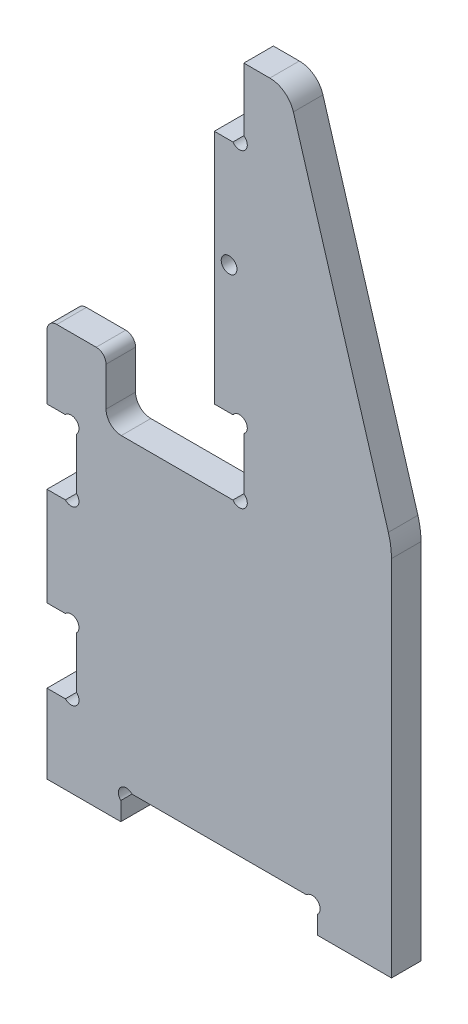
ISO-10303-21;
HEADER;
FILE_DESCRIPTION(('STEP AP214'),'2;1');
FILE_NAME('part.step','',(''),(''),'','','');
FILE_SCHEMA(('AUTOMOTIVE_DESIGN { 1 0 10303 214 1 1 1 1 }'));
ENDSEC;
DATA;
#1=APPLICATION_CONTEXT('core data for automotive mechanical design processes');
#2=APPLICATION_PROTOCOL_DEFINITION('international standard','automotive_design',2000,#1);
#3=PRODUCT_CONTEXT('',#1,'mechanical');
#4=PRODUCT('Part','Part','',(#3));
#5=PRODUCT_RELATED_PRODUCT_CATEGORY('part','',(#4));
#6=PRODUCT_DEFINITION_FORMATION('','',#4);
#7=PRODUCT_DEFINITION_CONTEXT('part definition',#1,'design');
#8=PRODUCT_DEFINITION('design','',#6,#7);
#9=PRODUCT_DEFINITION_SHAPE('','',#8);
#10=(LENGTH_UNIT() NAMED_UNIT(*) SI_UNIT(.MILLI.,.METRE.));
#11=(NAMED_UNIT(*) PLANE_ANGLE_UNIT() SI_UNIT($,.RADIAN.));
#12=(NAMED_UNIT(*) SI_UNIT($,.STERADIAN.) SOLID_ANGLE_UNIT());
#13=UNCERTAINTY_MEASURE_WITH_UNIT(LENGTH_MEASURE(1.E-05),#10,'distance_accuracy_value','');
#14=(GEOMETRIC_REPRESENTATION_CONTEXT(3) GLOBAL_UNCERTAINTY_ASSIGNED_CONTEXT((#13)) GLOBAL_UNIT_ASSIGNED_CONTEXT((#10,
#11,#12)) REPRESENTATION_CONTEXT('',''));
#15=CARTESIAN_POINT('',(0.,0.,0.));
#16=DIRECTION('',(0.,0.,1.));
#17=DIRECTION('',(1.,0.,0.));
#18=AXIS2_PLACEMENT_3D('',#15,#16,#17);
#19=CARTESIAN_POINT('',(-13.,3.,-6.));
#20=DIRECTION('',(0.,0.,1.));
#21=DIRECTION('',(1.,0.,0.));
#22=AXIS2_PLACEMENT_3D('',#19,#20,#21);
#23=CYLINDRICAL_SURFACE('',#22,2.);
#24=CARTESIAN_POINT('',(-13.,3.,0.));
#25=DIRECTION('',(0.,0.,1.));
#26=DIRECTION('',(-1.,0.,0.));
#27=AXIS2_PLACEMENT_3D('',#24,#25,#26);
#28=CIRCLE('',#27,2.);
#29=CARTESIAN_POINT('',(-13.,5.,0.));
#30=VERTEX_POINT('',#29);
#31=CARTESIAN_POINT('',(-15.,2.99999999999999,0.));
#32=VERTEX_POINT('',#31);
#33=EDGE_CURVE('E285',#30,#32,#28,.T.);
#34=ORIENTED_EDGE('',*,*,#33,.F.);
#35=DIRECTION('',(0.,0.,1.));
#36=VECTOR('',#35,1.);
#37=CARTESIAN_POINT('',(-13.,5.,-6.));
#38=LINE('',#37,#36);
#39=CARTESIAN_POINT('',(-13.,5.,-6.));
#40=VERTEX_POINT('',#39);
#41=EDGE_CURVE('E11',#40,#30,#38,.T.);
#42=ORIENTED_EDGE('',*,*,#41,.F.);
#43=CARTESIAN_POINT('',(-13.,3.,-6.));
#44=DIRECTION('',(0.,0.,1.));
#45=DIRECTION('',(-1.,0.,0.));
#46=AXIS2_PLACEMENT_3D('',#43,#44,#45);
#47=CIRCLE('',#46,2.);
#48=CARTESIAN_POINT('',(-15.,2.99999999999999,-6.));
#49=VERTEX_POINT('',#48);
#50=EDGE_CURVE('E287',#40,#49,#47,.T.);
#51=ORIENTED_EDGE('',*,*,#50,.T.);
#52=DIRECTION('',(0.,0.,1.));
#53=VECTOR('',#52,1.);
#54=CARTESIAN_POINT('',(-15.,2.99999999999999,-6.));
#55=LINE('',#54,#53);
#56=EDGE_CURVE('E38',#49,#32,#55,.T.);
#57=ORIENTED_EDGE('',*,*,#56,.T.);
#58=EDGE_LOOP('',(#34,#42,#51,#57));
#59=FACE_BOUND('',#58,.T.);
#60=ADVANCED_FACE('F35',(#59),#23,.T.);
#61=CARTESIAN_POINT('',(-13.,5.,-6.));
#62=DIRECTION('',(0.,1.,0.));
#63=DIRECTION('',(-1.,0.,0.));
#64=AXIS2_PLACEMENT_3D('',#61,#62,#63);
#65=PLANE('',#64);
#66=DIRECTION('',(-1.,0.,0.));
#67=VECTOR('',#66,1.);
#68=CARTESIAN_POINT('',(-13.,5.,0.));
#69=LINE('',#68,#67);
#70=CARTESIAN_POINT('',(-5.00000000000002,5.,0.));
#71=VERTEX_POINT('',#70);
#72=EDGE_CURVE('E303',#71,#30,#69,.T.);
#73=ORIENTED_EDGE('',*,*,#72,.F.);
#74=DIRECTION('',(0.,0.,1.));
#75=VECTOR('',#74,1.);
#76=CARTESIAN_POINT('',(-5.00000000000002,5.,-6.));
#77=LINE('',#76,#75);
#78=CARTESIAN_POINT('',(-5.00000000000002,5.,-6.));
#79=VERTEX_POINT('',#78);
#80=EDGE_CURVE('E43',#79,#71,#77,.T.);
#81=ORIENTED_EDGE('',*,*,#80,.F.);
#82=DIRECTION('',(-1.,0.,0.));
#83=VECTOR('',#82,1.);
#84=CARTESIAN_POINT('',(-13.,5.,-6.));
#85=LINE('',#84,#83);
#86=EDGE_CURVE('E292',#79,#40,#85,.T.);
#87=ORIENTED_EDGE('',*,*,#86,.T.);
#88=ORIENTED_EDGE('',*,*,#41,.T.);
#89=EDGE_LOOP('',(#73,#81,#87,#88));
#90=FACE_BOUND('',#89,.T.);
#91=ADVANCED_FACE('F741',(#90),#65,.T.);
#92=CARTESIAN_POINT('',(-5.00000000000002,3.,-6.));
#93=DIRECTION('',(0.,0.,1.));
#94=DIRECTION('',(1.,0.,0.));
#95=AXIS2_PLACEMENT_3D('',#92,#93,#94);
#96=CYLINDRICAL_SURFACE('',#95,2.);
#97=CARTESIAN_POINT('',(-5.00000000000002,3.,0.));
#98=DIRECTION('',(0.,0.,1.));
#99=DIRECTION('',(-1.,0.,0.));
#100=AXIS2_PLACEMENT_3D('',#97,#98,#99);
#101=CIRCLE('',#100,2.);
#102=CARTESIAN_POINT('',(-3.00000000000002,3.,0.));
#103=VERTEX_POINT('',#102);
#104=EDGE_CURVE('E414',#103,#71,#101,.T.);
#105=ORIENTED_EDGE('',*,*,#104,.F.);
#106=DIRECTION('',(0.,0.,1.));
#107=VECTOR('',#106,1.);
#108=CARTESIAN_POINT('',(-3.00000000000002,3.,-6.));
#109=LINE('',#108,#107);
#110=CARTESIAN_POINT('',(-3.00000000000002,3.,-6.));
#111=VERTEX_POINT('',#110);
#112=EDGE_CURVE('E527',#111,#103,#109,.T.);
#113=ORIENTED_EDGE('',*,*,#112,.F.);
#114=CARTESIAN_POINT('',(-5.00000000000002,3.,-6.));
#115=DIRECTION('',(0.,0.,1.));
#116=DIRECTION('',(-1.,0.,0.));
#117=AXIS2_PLACEMENT_3D('',#114,#115,#116);
#118=CIRCLE('',#117,2.);
#119=EDGE_CURVE('E523',#111,#79,#118,.T.);
#120=ORIENTED_EDGE('',*,*,#119,.T.);
#121=ORIENTED_EDGE('',*,*,#80,.T.);
#122=EDGE_LOOP('',(#105,#113,#120,#121));
#123=FACE_BOUND('',#122,.T.);
#124=ADVANCED_FACE('F744',(#123),#96,.T.);
#125=CARTESIAN_POINT('',(-3.00000000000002,-4.89999999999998,-6.));
#126=DIRECTION('',(1.,0.,0.));
#127=DIRECTION('',(0.,0.,-1.));
#128=AXIS2_PLACEMENT_3D('',#125,#126,#127);
#129=PLANE('',#128);
#130=DIRECTION('',(0.,1.,0.));
#131=VECTOR('',#130,1.);
#132=CARTESIAN_POINT('',(-3.00000000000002,-4.89999999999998,0.));
#133=LINE('',#132,#131);
#134=CARTESIAN_POINT('',(-3.00000000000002,-4.89999999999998,0.));
#135=VERTEX_POINT('',#134);
#136=EDGE_CURVE('E411',#135,#103,#133,.T.);
#137=ORIENTED_EDGE('',*,*,#136,.F.);
#138=DIRECTION('',(0.,0.,1.));
#139=VECTOR('',#138,1.);
#140=CARTESIAN_POINT('',(-3.00000000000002,-4.89999999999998,-6.));
#141=LINE('',#140,#139);
#142=CARTESIAN_POINT('',(-3.00000000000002,-4.89999999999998,-6.));
#143=VERTEX_POINT('',#142);
#144=EDGE_CURVE('E529',#143,#135,#141,.T.);
#145=ORIENTED_EDGE('',*,*,#144,.F.);
#146=DIRECTION('',(0.,1.,0.));
#147=VECTOR('',#146,1.);
#148=CARTESIAN_POINT('',(-3.00000000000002,-4.89999999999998,-6.));
#149=LINE('',#148,#147);
#150=EDGE_CURVE('E520',#143,#111,#149,.T.);
#151=ORIENTED_EDGE('',*,*,#150,.T.);
#152=ORIENTED_EDGE('',*,*,#112,.T.);
#153=EDGE_LOOP('',(#137,#145,#151,#152));
#154=FACE_BOUND('',#153,.T.);
#155=ADVANCED_FACE('F738',(#154),#129,.T.);
#156=CARTESIAN_POINT('',(0.0999999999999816,-4.9,-6.));
#157=DIRECTION('',(0.,0.,1.));
#158=DIRECTION('',(1.,0.,0.));
#159=AXIS2_PLACEMENT_3D('',#156,#157,#158);
#160=CYLINDRICAL_SURFACE('',#159,3.1);
#161=CARTESIAN_POINT('',(0.0999999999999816,-4.9,0.));
#162=DIRECTION('',(0.,0.,-1.));
#163=DIRECTION('',(-1.,0.,0.));
#164=AXIS2_PLACEMENT_3D('',#161,#162,#163);
#165=CIRCLE('',#164,3.1);
#166=CARTESIAN_POINT('',(0.100000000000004,-8.,0.));
#167=VERTEX_POINT('',#166);
#168=EDGE_CURVE('E408',#167,#135,#165,.T.);
#169=ORIENTED_EDGE('',*,*,#168,.F.);
#170=DIRECTION('',(0.,0.,1.));
#171=VECTOR('',#170,1.);
#172=CARTESIAN_POINT('',(0.100000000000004,-8.,-6.));
#173=LINE('',#172,#171);
#174=CARTESIAN_POINT('',(0.100000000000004,-8.,-6.));
#175=VERTEX_POINT('',#174);
#176=EDGE_CURVE('E531',#175,#167,#173,.T.);
#177=ORIENTED_EDGE('',*,*,#176,.F.);
#178=CARTESIAN_POINT('',(0.0999999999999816,-4.9,-6.));
#179=DIRECTION('',(0.,0.,-1.));
#180=DIRECTION('',(-1.,0.,0.));
#181=AXIS2_PLACEMENT_3D('',#178,#179,#180);
#182=CIRCLE('',#181,3.1);
#183=EDGE_CURVE('E517',#175,#143,#182,.T.);
#184=ORIENTED_EDGE('',*,*,#183,.T.);
#185=ORIENTED_EDGE('',*,*,#144,.T.);
#186=EDGE_LOOP('',(#169,#177,#184,#185));
#187=FACE_BOUND('',#186,.T.);
#188=ADVANCED_FACE('F734',(#187),#160,.F.);
#189=CARTESIAN_POINT('',(0.100000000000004,-8.,-6.));
#190=DIRECTION('',(0.,1.,0.));
#191=DIRECTION('',(-1.,0.,0.));
#192=AXIS2_PLACEMENT_3D('',#189,#190,#191);
#193=PLANE('',#192);
#194=DIRECTION('',(-1.,0.,0.));
#195=VECTOR('',#194,1.);
#196=CARTESIAN_POINT('',(0.100000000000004,-8.,0.));
#197=LINE('',#196,#195);
#198=CARTESIAN_POINT('',(22.7771243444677,-8.,0.));
#199=VERTEX_POINT('',#198);
#200=EDGE_CURVE('E405',#199,#167,#197,.T.);
#201=ORIENTED_EDGE('',*,*,#200,.F.);
#202=DIRECTION('',(0.,0.,1.));
#203=VECTOR('',#202,1.);
#204=CARTESIAN_POINT('',(22.7771243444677,-8.,-6.));
#205=LINE('',#204,#203);
#206=CARTESIAN_POINT('',(22.7771243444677,-8.,-6.));
#207=VERTEX_POINT('',#206);
#208=EDGE_CURVE('E533',#207,#199,#205,.T.);
#209=ORIENTED_EDGE('',*,*,#208,.F.);
#210=DIRECTION('',(-1.,0.,0.));
#211=VECTOR('',#210,1.);
#212=CARTESIAN_POINT('',(22.7771243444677,-8.,-6.));
#213=LINE('',#212,#211);
#214=EDGE_CURVE('E515',#207,#175,#213,.T.);
#215=ORIENTED_EDGE('',*,*,#214,.T.);
#216=ORIENTED_EDGE('',*,*,#176,.T.);
#217=EDGE_LOOP('',(#201,#209,#215,#216));
#218=FACE_BOUND('',#217,.T.);
#219=ADVANCED_FACE('F729',(#218),#193,.T.);
#220=CARTESIAN_POINT('',(24.1,-7.1,-6.));
#221=DIRECTION('',(0.,0.,1.));
#222=DIRECTION('',(1.,0.,0.));
#223=AXIS2_PLACEMENT_3D('',#220,#221,#222);
#224=CYLINDRICAL_SURFACE('',#223,1.6);
#225=CARTESIAN_POINT('',(24.1,-7.1,0.));
#226=DIRECTION('',(0.,0.,-1.));
#227=DIRECTION('',(1.,0.,0.));
#228=AXIS2_PLACEMENT_3D('',#225,#226,#227);
#229=CIRCLE('',#228,1.6);
#230=CARTESIAN_POINT('',(25.,-5.77712434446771,0.));
#231=VERTEX_POINT('',#230);
#232=EDGE_CURVE('E402',#231,#199,#229,.T.);
#233=ORIENTED_EDGE('',*,*,#232,.F.);
#234=DIRECTION('',(0.,0.,1.));
#235=VECTOR('',#234,1.);
#236=CARTESIAN_POINT('',(25.,-5.77712434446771,-6.));
#237=LINE('',#236,#235);
#238=CARTESIAN_POINT('',(25.,-5.77712434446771,-6.));
#239=VERTEX_POINT('',#238);
#240=EDGE_CURVE('E536',#239,#231,#237,.T.);
#241=ORIENTED_EDGE('',*,*,#240,.F.);
#242=CARTESIAN_POINT('',(24.1,-7.1,-6.));
#243=DIRECTION('',(0.,0.,-1.));
#244=DIRECTION('',(1.,0.,0.));
#245=AXIS2_PLACEMENT_3D('',#242,#243,#244);
#246=CIRCLE('',#245,1.6);
#247=EDGE_CURVE('E512',#239,#207,#246,.T.);
#248=ORIENTED_EDGE('',*,*,#247,.T.);
#249=ORIENTED_EDGE('',*,*,#208,.T.);
#250=EDGE_LOOP('',(#233,#241,#248,#249));
#251=FACE_BOUND('',#250,.T.);
#252=ADVANCED_FACE('F726',(#251),#224,.F.);
#253=CARTESIAN_POINT('',(25.,4.77712434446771,-6.));
#254=DIRECTION('',(-1.,0.,0.));
#255=DIRECTION('',(0.,0.,1.));
#256=AXIS2_PLACEMENT_3D('',#253,#254,#255);
#257=PLANE('',#256);
#258=DIRECTION('',(0.,-1.,0.));
#259=VECTOR('',#258,1.);
#260=CARTESIAN_POINT('',(25.,4.77712434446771,0.));
#261=LINE('',#260,#259);
#262=CARTESIAN_POINT('',(25.,4.77712434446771,0.));
#263=VERTEX_POINT('',#262);
#264=EDGE_CURVE('E399',#263,#231,#261,.T.);
#265=ORIENTED_EDGE('',*,*,#264,.F.);
#266=DIRECTION('',(0.,0.,1.));
#267=VECTOR('',#266,1.);
#268=CARTESIAN_POINT('',(25.,4.77712434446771,-6.));
#269=LINE('',#268,#267);
#270=CARTESIAN_POINT('',(25.,4.77712434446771,-6.));
#271=VERTEX_POINT('',#270);
#272=EDGE_CURVE('E538',#271,#263,#269,.T.);
#273=ORIENTED_EDGE('',*,*,#272,.F.);
#274=DIRECTION('',(0.,-1.,0.));
#275=VECTOR('',#274,1.);
#276=CARTESIAN_POINT('',(25.,4.77712434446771,-6.));
#277=LINE('',#276,#275);
#278=EDGE_CURVE('E509',#271,#239,#277,.T.);
#279=ORIENTED_EDGE('',*,*,#278,.T.);
#280=ORIENTED_EDGE('',*,*,#240,.T.);
#281=EDGE_LOOP('',(#265,#273,#279,#280));
#282=FACE_BOUND('',#281,.T.);
#283=ADVANCED_FACE('F722',(#282),#257,.T.);
#284=CARTESIAN_POINT('',(24.1,6.1,-6.));
#285=DIRECTION('',(0.,0.,1.));
#286=DIRECTION('',(1.,0.,0.));
#287=AXIS2_PLACEMENT_3D('',#284,#285,#286);
#288=CYLINDRICAL_SURFACE('',#287,1.6);
#289=CARTESIAN_POINT('',(24.1,6.1,0.));
#290=DIRECTION('',(0.,0.,-1.));
#291=DIRECTION('',(1.,0.,0.));
#292=AXIS2_PLACEMENT_3D('',#289,#290,#291);
#293=CIRCLE('',#292,1.6);
#294=CARTESIAN_POINT('',(22.7771243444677,7.,0.));
#295=VERTEX_POINT('',#294);
#296=EDGE_CURVE('E396',#295,#263,#293,.T.);
#297=ORIENTED_EDGE('',*,*,#296,.F.);
#298=DIRECTION('',(0.,0.,1.));
#299=VECTOR('',#298,1.);
#300=CARTESIAN_POINT('',(22.7771243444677,7.,-6.));
#301=LINE('',#300,#299);
#302=CARTESIAN_POINT('',(22.7771243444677,7.,-6.));
#303=VERTEX_POINT('',#302);
#304=EDGE_CURVE('E540',#303,#295,#301,.T.);
#305=ORIENTED_EDGE('',*,*,#304,.F.);
#306=CARTESIAN_POINT('',(24.1,6.1,-6.));
#307=DIRECTION('',(0.,0.,-1.));
#308=DIRECTION('',(1.,0.,0.));
#309=AXIS2_PLACEMENT_3D('',#306,#307,#308);
#310=CIRCLE('',#309,1.6);
#311=EDGE_CURVE('E506',#303,#271,#310,.T.);
#312=ORIENTED_EDGE('',*,*,#311,.T.);
#313=ORIENTED_EDGE('',*,*,#272,.T.);
#314=EDGE_LOOP('',(#297,#305,#312,#313));
#315=FACE_BOUND('',#314,.T.);
#316=ADVANCED_FACE('F718',(#315),#288,.F.);
#317=CARTESIAN_POINT('',(19.,7.,-6.));
#318=DIRECTION('',(0.,-1.,0.));
#319=DIRECTION('',(1.,0.,0.));
#320=AXIS2_PLACEMENT_3D('',#317,#318,#319);
#321=PLANE('',#320);
#322=DIRECTION('',(1.,0.,0.));
#323=VECTOR('',#322,1.);
#324=CARTESIAN_POINT('',(19.,7.,0.));
#325=LINE('',#324,#323);
#326=CARTESIAN_POINT('',(19.,7.,0.));
#327=VERTEX_POINT('',#326);
#328=EDGE_CURVE('E393',#327,#295,#325,.T.);
#329=ORIENTED_EDGE('',*,*,#328,.F.);
#330=DIRECTION('',(0.,0.,1.));
#331=VECTOR('',#330,1.);
#332=CARTESIAN_POINT('',(19.,7.,-6.));
#333=LINE('',#332,#331);
#334=CARTESIAN_POINT('',(19.,7.,-6.));
#335=VERTEX_POINT('',#334);
#336=EDGE_CURVE('E542',#335,#327,#333,.T.);
#337=ORIENTED_EDGE('',*,*,#336,.F.);
#338=DIRECTION('',(1.,0.,0.));
#339=VECTOR('',#338,1.);
#340=CARTESIAN_POINT('',(19.,7.,-6.));
#341=LINE('',#340,#339);
#342=EDGE_CURVE('E503',#335,#303,#341,.T.);
#343=ORIENTED_EDGE('',*,*,#342,.T.);
#344=ORIENTED_EDGE('',*,*,#304,.T.);
#345=EDGE_LOOP('',(#329,#337,#343,#344));
#346=FACE_BOUND('',#345,.T.);
#347=ADVANCED_FACE('F714',(#346),#321,.T.);
#348=CARTESIAN_POINT('',(19.,7.,-6.));
#349=DIRECTION('',(-1.,0.,0.));
#350=DIRECTION('',(0.,-1.,0.));
#351=AXIS2_PLACEMENT_3D('',#348,#349,#350);
#352=PLANE('',#351);
#353=DIRECTION('',(0.,-1.,0.));
#354=VECTOR('',#353,1.);
#355=CARTESIAN_POINT('',(19.,7.,0.));
#356=LINE('',#355,#354);
#357=CARTESIAN_POINT('',(19.,55.,0.));
#358=VERTEX_POINT('',#357);
#359=EDGE_CURVE('E390',#358,#327,#356,.T.);
#360=ORIENTED_EDGE('',*,*,#359,.F.);
#361=DIRECTION('',(0.,0.,1.));
#362=VECTOR('',#361,1.);
#363=CARTESIAN_POINT('',(19.,55.,-6.));
#364=LINE('',#363,#362);
#365=CARTESIAN_POINT('',(19.,55.,-6.));
#366=VERTEX_POINT('',#365);
#367=EDGE_CURVE('E544',#366,#358,#364,.T.);
#368=ORIENTED_EDGE('',*,*,#367,.F.);
#369=DIRECTION('',(0.,-1.,0.));
#370=VECTOR('',#369,1.);
#371=CARTESIAN_POINT('',(19.,7.,-6.));
#372=LINE('',#371,#370);
#373=EDGE_CURVE('E500',#366,#335,#372,.T.);
#374=ORIENTED_EDGE('',*,*,#373,.T.);
#375=ORIENTED_EDGE('',*,*,#336,.T.);
#376=EDGE_LOOP('',(#360,#368,#374,#375));
#377=FACE_BOUND('',#376,.T.);
#378=ADVANCED_FACE('F710',(#377),#352,.T.);
#379=CARTESIAN_POINT('',(22.7771243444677,55.,-6.));
#380=DIRECTION('',(0.,1.,0.));
#381=DIRECTION('',(0.,0.,1.));
#382=AXIS2_PLACEMENT_3D('',#379,#380,#381);
#383=PLANE('',#382);
#384=DIRECTION('',(-1.,0.,0.));
#385=VECTOR('',#384,1.);
#386=CARTESIAN_POINT('',(22.7771243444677,55.,0.));
#387=LINE('',#386,#385);
#388=CARTESIAN_POINT('',(22.7771243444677,55.,0.));
#389=VERTEX_POINT('',#388);
#390=EDGE_CURVE('E387',#389,#358,#387,.T.);
#391=ORIENTED_EDGE('',*,*,#390,.F.);
#392=DIRECTION('',(0.,0.,1.));
#393=VECTOR('',#392,1.);
#394=CARTESIAN_POINT('',(22.7771243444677,55.,-6.));
#395=LINE('',#394,#393);
#396=CARTESIAN_POINT('',(22.7771243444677,55.,-6.));
#397=VERTEX_POINT('',#396);
#398=EDGE_CURVE('E546',#397,#389,#395,.T.);
#399=ORIENTED_EDGE('',*,*,#398,.F.);
#400=DIRECTION('',(-1.,0.,0.));
#401=VECTOR('',#400,1.);
#402=CARTESIAN_POINT('',(22.7771243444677,55.,-6.));
#403=LINE('',#402,#401);
#404=EDGE_CURVE('E497',#397,#366,#403,.T.);
#405=ORIENTED_EDGE('',*,*,#404,.T.);
#406=ORIENTED_EDGE('',*,*,#367,.T.);
#407=EDGE_LOOP('',(#391,#399,#405,#406));
#408=FACE_BOUND('',#407,.T.);
#409=ADVANCED_FACE('F706',(#408),#383,.T.);
#410=CARTESIAN_POINT('',(24.1,55.9,-6.));
#411=DIRECTION('',(0.,0.,1.));
#412=DIRECTION('',(1.,0.,0.));
#413=AXIS2_PLACEMENT_3D('',#410,#411,#412);
#414=CYLINDRICAL_SURFACE('',#413,1.6);
#415=CARTESIAN_POINT('',(24.1,55.9,0.));
#416=DIRECTION('',(0.,0.,-1.));
#417=DIRECTION('',(1.,0.,0.));
#418=AXIS2_PLACEMENT_3D('',#415,#416,#417);
#419=CIRCLE('',#418,1.6);
#420=CARTESIAN_POINT('',(25.,57.2228756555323,0.));
#421=VERTEX_POINT('',#420);
#422=EDGE_CURVE('E384',#421,#389,#419,.T.);
#423=ORIENTED_EDGE('',*,*,#422,.F.);
#424=DIRECTION('',(0.,0.,1.));
#425=VECTOR('',#424,1.);
#426=CARTESIAN_POINT('',(25.,57.2228756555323,-6.));
#427=LINE('',#426,#425);
#428=CARTESIAN_POINT('',(25.,57.2228756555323,-6.));
#429=VERTEX_POINT('',#428);
#430=EDGE_CURVE('E548',#429,#421,#427,.T.);
#431=ORIENTED_EDGE('',*,*,#430,.F.);
#432=CARTESIAN_POINT('',(24.1,55.9,-6.));
#433=DIRECTION('',(0.,0.,-1.));
#434=DIRECTION('',(1.,0.,0.));
#435=AXIS2_PLACEMENT_3D('',#432,#433,#434);
#436=CIRCLE('',#435,1.6);
#437=EDGE_CURVE('E494',#429,#397,#436,.T.);
#438=ORIENTED_EDGE('',*,*,#437,.T.);
#439=ORIENTED_EDGE('',*,*,#398,.T.);
#440=EDGE_LOOP('',(#423,#431,#438,#439));
#441=FACE_BOUND('',#440,.T.);
#442=ADVANCED_FACE('F702',(#441),#414,.F.);
#443=CARTESIAN_POINT('',(25.,70.,-6.));
#444=DIRECTION('',(-1.,0.,0.));
#445=DIRECTION('',(0.,0.,1.));
#446=AXIS2_PLACEMENT_3D('',#443,#444,#445);
#447=PLANE('',#446);
#448=DIRECTION('',(0.,-1.,0.));
#449=VECTOR('',#448,1.);
#450=CARTESIAN_POINT('',(25.,70.,0.));
#451=LINE('',#450,#449);
#452=CARTESIAN_POINT('',(25.,70.,0.));
#453=VERTEX_POINT('',#452);
#454=EDGE_CURVE('E381',#453,#421,#451,.T.);
#455=ORIENTED_EDGE('',*,*,#454,.F.);
#456=DIRECTION('',(0.,0.,1.));
#457=VECTOR('',#456,1.);
#458=CARTESIAN_POINT('',(25.,70.,-6.));
#459=LINE('',#458,#457);
#460=CARTESIAN_POINT('',(25.,70.,-6.));
#461=VERTEX_POINT('',#460);
#462=EDGE_CURVE('E550',#461,#453,#459,.T.);
#463=ORIENTED_EDGE('',*,*,#462,.F.);
#464=DIRECTION('',(0.,-1.,0.));
#465=VECTOR('',#464,1.);
#466=CARTESIAN_POINT('',(25.,70.,-6.));
#467=LINE('',#466,#465);
#468=EDGE_CURVE('E491',#461,#429,#467,.T.);
#469=ORIENTED_EDGE('',*,*,#468,.T.);
#470=ORIENTED_EDGE('',*,*,#430,.T.);
#471=EDGE_LOOP('',(#455,#463,#469,#470));
#472=FACE_BOUND('',#471,.T.);
#473=ADVANCED_FACE('F698',(#472),#447,.T.);
#474=CARTESIAN_POINT('',(25.,70.,-6.));
#475=DIRECTION('',(0.,1.,0.));
#476=DIRECTION('',(0.,0.,1.));
#477=AXIS2_PLACEMENT_3D('',#474,#475,#476);
#478=PLANE('',#477);
#479=DIRECTION('',(-1.,0.,0.));
#480=VECTOR('',#479,1.);
#481=CARTESIAN_POINT('',(25.,70.,0.));
#482=LINE('',#481,#480);
#483=CARTESIAN_POINT('',(30.2798467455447,70.,0.));
#484=VERTEX_POINT('',#483);
#485=EDGE_CURVE('E378',#484,#453,#482,.T.);
#486=ORIENTED_EDGE('',*,*,#485,.F.);
#487=DIRECTION('',(0.,0.,1.));
#488=VECTOR('',#487,1.);
#489=CARTESIAN_POINT('',(30.2798467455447,70.,-6.));
#490=LINE('',#489,#488);
#491=CARTESIAN_POINT('',(30.2798467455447,70.,-6.));
#492=VERTEX_POINT('',#491);
#493=EDGE_CURVE('E552',#492,#484,#490,.T.);
#494=ORIENTED_EDGE('',*,*,#493,.F.);
#495=DIRECTION('',(-1.,0.,0.));
#496=VECTOR('',#495,1.);
#497=CARTESIAN_POINT('',(25.,70.,-6.));
#498=LINE('',#497,#496);
#499=EDGE_CURVE('E488',#492,#461,#498,.T.);
#500=ORIENTED_EDGE('',*,*,#499,.T.);
#501=ORIENTED_EDGE('',*,*,#462,.T.);
#502=EDGE_LOOP('',(#486,#494,#500,#501));
#503=FACE_BOUND('',#502,.T.);
#504=ADVANCED_FACE('F694',(#503),#478,.T.);
#505=CARTESIAN_POINT('',(30.2798467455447,65.,-6.));
#506=DIRECTION('',(0.,0.,1.));
#507=DIRECTION('',(1.,0.,0.));
#508=AXIS2_PLACEMENT_3D('',#505,#506,#507);
#509=CYLINDRICAL_SURFACE('',#508,5.);
#510=CARTESIAN_POINT('',(30.2798467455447,65.,0.));
#511=DIRECTION('',(0.,0.,1.));
#512=DIRECTION('',(-1.,0.,0.));
#513=AXIS2_PLACEMENT_3D('',#510,#511,#512);
#514=CIRCLE('',#513,5.);
#515=CARTESIAN_POINT('',(35.0689781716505,66.4367394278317,0.));
#516=VERTEX_POINT('',#515);
#517=EDGE_CURVE('E375',#516,#484,#514,.T.);
#518=ORIENTED_EDGE('',*,*,#517,.F.);
#519=DIRECTION('',(0.,0.,1.));
#520=VECTOR('',#519,1.);
#521=CARTESIAN_POINT('',(35.0689781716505,66.4367394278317,-6.));
#522=LINE('',#521,#520);
#523=CARTESIAN_POINT('',(35.0689781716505,66.4367394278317,-6.));
#524=VERTEX_POINT('',#523);
#525=EDGE_CURVE('E554',#524,#516,#522,.T.);
#526=ORIENTED_EDGE('',*,*,#525,.F.);
#527=CARTESIAN_POINT('',(30.2798467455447,65.,-6.));
#528=DIRECTION('',(0.,0.,1.));
#529=DIRECTION('',(-1.,0.,0.));
#530=AXIS2_PLACEMENT_3D('',#527,#528,#529);
#531=CIRCLE('',#530,5.);
#532=EDGE_CURVE('E485',#524,#492,#531,.T.);
#533=ORIENTED_EDGE('',*,*,#532,.T.);
#534=ORIENTED_EDGE('',*,*,#493,.T.);
#535=EDGE_LOOP('',(#518,#526,#533,#534));
#536=FACE_BOUND('',#535,.T.);
#537=ADVANCED_FACE('F690',(#536),#509,.T.);
#538=CARTESIAN_POINT('',(35.0689781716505,66.4367394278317,-6.));
#539=DIRECTION('',(0.957826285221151,0.287347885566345,0.));
#540=DIRECTION('',(-0.287347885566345,0.957826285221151,0.));
#541=AXIS2_PLACEMENT_3D('',#538,#539,#540);
#542=PLANE('',#541);
#543=DIRECTION('',(-0.287347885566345,0.957826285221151,0.));
#544=VECTOR('',#543,1.);
#545=CARTESIAN_POINT('',(35.0689781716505,66.4367394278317,0.));
#546=LINE('',#545,#544);
#547=CARTESIAN_POINT('',(54.3673942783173,2.10868573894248,0.));
#548=VERTEX_POINT('',#547);
#549=EDGE_CURVE('E372',#548,#516,#546,.T.);
#550=ORIENTED_EDGE('',*,*,#549,.F.);
#551=DIRECTION('',(0.,0.,1.));
#552=VECTOR('',#551,1.);
#553=CARTESIAN_POINT('',(54.3673942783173,2.10868573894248,-6.));
#554=LINE('',#553,#552);
#555=CARTESIAN_POINT('',(54.3673942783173,2.10868573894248,-6.));
#556=VERTEX_POINT('',#555);
#557=EDGE_CURVE('E556',#556,#548,#554,.T.);
#558=ORIENTED_EDGE('',*,*,#557,.F.);
#559=DIRECTION('',(-0.287347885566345,0.957826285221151,0.));
#560=VECTOR('',#559,1.);
#561=CARTESIAN_POINT('',(35.0689781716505,66.4367394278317,-6.));
#562=LINE('',#561,#560);
#563=EDGE_CURVE('E482',#556,#524,#562,.T.);
#564=ORIENTED_EDGE('',*,*,#563,.T.);
#565=ORIENTED_EDGE('',*,*,#525,.T.);
#566=EDGE_LOOP('',(#550,#558,#564,#565));
#567=FACE_BOUND('',#566,.T.);
#568=ADVANCED_FACE('F686',(#567),#542,.T.);
#569=CARTESIAN_POINT('',(40.,-2.20153254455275,-6.));
#570=DIRECTION('',(0.,0.,1.));
#571=DIRECTION('',(1.,0.,0.));
#572=AXIS2_PLACEMENT_3D('',#569,#570,#571);
#573=CYLINDRICAL_SURFACE('',#572,15.);
#574=CARTESIAN_POINT('',(40.,-2.20153254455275,0.));
#575=DIRECTION('',(0.,0.,1.));
#576=DIRECTION('',(-1.,0.,0.));
#577=AXIS2_PLACEMENT_3D('',#574,#575,#576);
#578=CIRCLE('',#577,15.);
#579=CARTESIAN_POINT('',(55.,-2.20153254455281,0.));
#580=VERTEX_POINT('',#579);
#581=EDGE_CURVE('E369',#580,#548,#578,.T.);
#582=ORIENTED_EDGE('',*,*,#581,.F.);
#583=DIRECTION('',(0.,0.,1.));
#584=VECTOR('',#583,1.);
#585=CARTESIAN_POINT('',(55.,-2.20153254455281,-6.));
#586=LINE('',#585,#584);
#587=CARTESIAN_POINT('',(55.,-2.20153254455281,-6.));
#588=VERTEX_POINT('',#587);
#589=EDGE_CURVE('E558',#588,#580,#586,.T.);
#590=ORIENTED_EDGE('',*,*,#589,.F.);
#591=CARTESIAN_POINT('',(40.,-2.20153254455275,-6.));
#592=DIRECTION('',(0.,0.,1.));
#593=DIRECTION('',(-1.,0.,0.));
#594=AXIS2_PLACEMENT_3D('',#591,#592,#593);
#595=CIRCLE('',#594,15.);
#596=EDGE_CURVE('E479',#588,#556,#595,.T.);
#597=ORIENTED_EDGE('',*,*,#596,.T.);
#598=ORIENTED_EDGE('',*,*,#557,.T.);
#599=EDGE_LOOP('',(#582,#590,#597,#598));
#600=FACE_BOUND('',#599,.T.);
#601=ADVANCED_FACE('F682',(#600),#573,.T.);
#602=CARTESIAN_POINT('',(55.,-2.20153254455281,-6.));
#603=DIRECTION('',(1.,0.,0.));
#604=DIRECTION('',(0.,0.,-1.));
#605=AXIS2_PLACEMENT_3D('',#602,#603,#604);
#606=PLANE('',#605);
#607=DIRECTION('',(0.,1.,0.));
#608=VECTOR('',#607,1.);
#609=CARTESIAN_POINT('',(55.,-2.20153254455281,0.));
#610=LINE('',#609,#608);
#611=CARTESIAN_POINT('',(55.,-76.,0.));
#612=VERTEX_POINT('',#611);
#613=EDGE_CURVE('E366',#612,#580,#610,.T.);
#614=ORIENTED_EDGE('',*,*,#613,.F.);
#615=DIRECTION('',(0.,0.,1.));
#616=VECTOR('',#615,1.);
#617=CARTESIAN_POINT('',(55.,-76.,-6.));
#618=LINE('',#617,#616);
#619=CARTESIAN_POINT('',(55.,-76.,-6.));
#620=VERTEX_POINT('',#619);
#621=EDGE_CURVE('E560',#620,#612,#618,.T.);
#622=ORIENTED_EDGE('',*,*,#621,.F.);
#623=DIRECTION('',(0.,1.,0.));
#624=VECTOR('',#623,1.);
#625=CARTESIAN_POINT('',(55.,-2.20153254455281,-6.));
#626=LINE('',#625,#624);
#627=EDGE_CURVE('E476',#620,#588,#626,.T.);
#628=ORIENTED_EDGE('',*,*,#627,.T.);
#629=ORIENTED_EDGE('',*,*,#589,.T.);
#630=EDGE_LOOP('',(#614,#622,#628,#629));
#631=FACE_BOUND('',#630,.T.);
#632=ADVANCED_FACE('F678',(#631),#606,.T.);
#633=CARTESIAN_POINT('',(55.,-76.,-6.));
#634=DIRECTION('',(0.,-1.,0.));
#635=DIRECTION('',(0.,0.,-1.));
#636=AXIS2_PLACEMENT_3D('',#633,#634,#635);
#637=PLANE('',#636);
#638=DIRECTION('',(1.,0.,0.));
#639=VECTOR('',#638,1.);
#640=CARTESIAN_POINT('',(55.,-76.,0.));
#641=LINE('',#640,#639);
#642=CARTESIAN_POINT('',(40.,-76.,0.));
#643=VERTEX_POINT('',#642);
#644=EDGE_CURVE('E363',#643,#612,#641,.T.);
#645=ORIENTED_EDGE('',*,*,#644,.F.);
#646=DIRECTION('',(0.,0.,1.));
#647=VECTOR('',#646,1.);
#648=CARTESIAN_POINT('',(40.,-76.,-6.));
#649=LINE('',#648,#647);
#650=CARTESIAN_POINT('',(40.,-76.,-6.));
#651=VERTEX_POINT('',#650);
#652=EDGE_CURVE('E562',#651,#643,#649,.T.);
#653=ORIENTED_EDGE('',*,*,#652,.F.);
#654=DIRECTION('',(1.,0.,0.));
#655=VECTOR('',#654,1.);
#656=CARTESIAN_POINT('',(55.,-76.,-6.));
#657=LINE('',#656,#655);
#658=EDGE_CURVE('E473',#651,#620,#657,.T.);
#659=ORIENTED_EDGE('',*,*,#658,.T.);
#660=ORIENTED_EDGE('',*,*,#621,.T.);
#661=EDGE_LOOP('',(#645,#653,#659,#660));
#662=FACE_BOUND('',#661,.T.);
#663=ADVANCED_FACE('F674',(#662),#637,.T.);
#664=CARTESIAN_POINT('',(40.,-76.,-6.));
#665=DIRECTION('',(-1.,0.,0.));
#666=DIRECTION('',(0.,-1.,0.));
#667=AXIS2_PLACEMENT_3D('',#664,#665,#666);
#668=PLANE('',#667);
#669=DIRECTION('',(0.,-1.,0.));
#670=VECTOR('',#669,1.);
#671=CARTESIAN_POINT('',(40.,-76.,0.));
#672=LINE('',#671,#670);
#673=CARTESIAN_POINT('',(40.,-72.2618950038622,0.));
#674=VERTEX_POINT('',#673);
#675=EDGE_CURVE('E360',#674,#643,#672,.T.);
#676=ORIENTED_EDGE('',*,*,#675,.F.);
#677=DIRECTION('',(0.,0.,1.));
#678=VECTOR('',#677,1.);
#679=CARTESIAN_POINT('',(40.,-72.2618950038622,-6.));
#680=LINE('',#679,#678);
#681=CARTESIAN_POINT('',(40.,-72.2618950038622,-6.));
#682=VERTEX_POINT('',#681);
#683=EDGE_CURVE('E564',#682,#674,#680,.T.);
#684=ORIENTED_EDGE('',*,*,#683,.F.);
#685=DIRECTION('',(0.,-1.,0.));
#686=VECTOR('',#685,1.);
#687=CARTESIAN_POINT('',(40.,-76.,-6.));
#688=LINE('',#687,#686);
#689=EDGE_CURVE('E470',#682,#651,#688,.T.);
#690=ORIENTED_EDGE('',*,*,#689,.T.);
#691=ORIENTED_EDGE('',*,*,#652,.T.);
#692=EDGE_LOOP('',(#676,#684,#690,#691));
#693=FACE_BOUND('',#692,.T.);
#694=ADVANCED_FACE('F672',(#693),#668,.T.);
#695=CARTESIAN_POINT('',(38.9,-71.1,-6.));
#696=DIRECTION('',(0.,0.,1.));
#697=DIRECTION('',(1.,0.,0.));
#698=AXIS2_PLACEMENT_3D('',#695,#696,#697);
#699=CYLINDRICAL_SURFACE('',#698,1.6);
#700=CARTESIAN_POINT('',(38.9,-71.1,0.));
#701=DIRECTION('',(0.,0.,-1.));
#702=DIRECTION('',(1.,0.,0.));
#703=AXIS2_PLACEMENT_3D('',#700,#701,#702);
#704=CIRCLE('',#703,1.6);
#705=CARTESIAN_POINT('',(37.7381049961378,-70.,0.));
#706=VERTEX_POINT('',#705);
#707=EDGE_CURVE('E357',#706,#674,#704,.T.);
#708=ORIENTED_EDGE('',*,*,#707,.F.);
#709=DIRECTION('',(0.,0.,1.));
#710=VECTOR('',#709,1.);
#711=CARTESIAN_POINT('',(37.7381049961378,-70.,-6.));
#712=LINE('',#711,#710);
#713=CARTESIAN_POINT('',(37.7381049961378,-70.,-6.));
#714=VERTEX_POINT('',#713);
#715=EDGE_CURVE('E566',#714,#706,#712,.T.);
#716=ORIENTED_EDGE('',*,*,#715,.F.);
#717=CARTESIAN_POINT('',(38.9,-71.1,-6.));
#718=DIRECTION('',(0.,0.,-1.));
#719=DIRECTION('',(1.,0.,0.));
#720=AXIS2_PLACEMENT_3D('',#717,#718,#719);
#721=CIRCLE('',#720,1.6);
#722=EDGE_CURVE('E467',#714,#682,#721,.T.);
#723=ORIENTED_EDGE('',*,*,#722,.T.);
#724=ORIENTED_EDGE('',*,*,#683,.T.);
#725=EDGE_LOOP('',(#708,#716,#723,#724));
#726=FACE_BOUND('',#725,.T.);
#727=ADVANCED_FACE('F668',(#726),#699,.F.);
#728=CARTESIAN_POINT('',(37.7381049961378,-70.,-6.));
#729=DIRECTION('',(0.,-1.,0.));
#730=DIRECTION('',(0.,0.,-1.));
#731=AXIS2_PLACEMENT_3D('',#728,#729,#730);
#732=PLANE('',#731);
#733=DIRECTION('',(1.,0.,0.));
#734=VECTOR('',#733,1.);
#735=CARTESIAN_POINT('',(37.7381049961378,-70.,0.));
#736=LINE('',#735,#734);
#737=CARTESIAN_POINT('',(2.26189500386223,-70.,0.));
#738=VERTEX_POINT('',#737);
#739=EDGE_CURVE('E354',#738,#706,#736,.T.);
#740=ORIENTED_EDGE('',*,*,#739,.F.);
#741=DIRECTION('',(0.,0.,1.));
#742=VECTOR('',#741,1.);
#743=CARTESIAN_POINT('',(2.26189500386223,-70.,-6.));
#744=LINE('',#743,#742);
#745=CARTESIAN_POINT('',(2.26189500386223,-70.,-6.));
#746=VERTEX_POINT('',#745);
#747=EDGE_CURVE('E568',#746,#738,#744,.T.);
#748=ORIENTED_EDGE('',*,*,#747,.F.);
#749=DIRECTION('',(1.,0.,0.));
#750=VECTOR('',#749,1.);
#751=CARTESIAN_POINT('',(19.,-70.,-6.));
#752=LINE('',#751,#750);
#753=EDGE_CURVE('E465',#746,#714,#752,.T.);
#754=ORIENTED_EDGE('',*,*,#753,.T.);
#755=ORIENTED_EDGE('',*,*,#715,.T.);
#756=EDGE_LOOP('',(#740,#748,#754,#755));
#757=FACE_BOUND('',#756,.T.);
#758=ADVANCED_FACE('F659',(#757),#732,.T.);
#759=CARTESIAN_POINT('',(1.1,-71.1,-6.));
#760=DIRECTION('',(0.,0.,1.));
#761=DIRECTION('',(1.,0.,0.));
#762=AXIS2_PLACEMENT_3D('',#759,#760,#761);
#763=CYLINDRICAL_SURFACE('',#762,1.6);
#764=CARTESIAN_POINT('',(1.1,-71.1,0.));
#765=DIRECTION('',(0.,0.,-1.));
#766=DIRECTION('',(1.,0.,0.));
#767=AXIS2_PLACEMENT_3D('',#764,#765,#766);
#768=CIRCLE('',#767,1.6);
#769=CARTESIAN_POINT('',(0.,-72.2618950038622,0.));
#770=VERTEX_POINT('',#769);
#771=EDGE_CURVE('E351',#770,#738,#768,.T.);
#772=ORIENTED_EDGE('',*,*,#771,.F.);
#773=DIRECTION('',(0.,0.,1.));
#774=VECTOR('',#773,1.);
#775=CARTESIAN_POINT('',(0.,-72.2618950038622,-6.));
#776=LINE('',#775,#774);
#777=CARTESIAN_POINT('',(0.,-72.2618950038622,-6.));
#778=VERTEX_POINT('',#777);
#779=EDGE_CURVE('E571',#778,#770,#776,.T.);
#780=ORIENTED_EDGE('',*,*,#779,.F.);
#781=CARTESIAN_POINT('',(1.1,-71.1,-6.));
#782=DIRECTION('',(0.,0.,-1.));
#783=DIRECTION('',(1.,0.,0.));
#784=AXIS2_PLACEMENT_3D('',#781,#782,#783);
#785=CIRCLE('',#784,1.6);
#786=EDGE_CURVE('E462',#778,#746,#785,.T.);
#787=ORIENTED_EDGE('',*,*,#786,.T.);
#788=ORIENTED_EDGE('',*,*,#747,.T.);
#789=EDGE_LOOP('',(#772,#780,#787,#788));
#790=FACE_BOUND('',#789,.T.);
#791=ADVANCED_FACE('F655',(#790),#763,.F.);
#792=CARTESIAN_POINT('',(0.,-72.2618950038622,-6.));
#793=DIRECTION('',(1.,0.,0.));
#794=DIRECTION('',(0.,1.,0.));
#795=AXIS2_PLACEMENT_3D('',#792,#793,#794);
#796=PLANE('',#795);
#797=DIRECTION('',(0.,1.,0.));
#798=VECTOR('',#797,1.);
#799=CARTESIAN_POINT('',(0.,-72.2618950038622,0.));
#800=LINE('',#799,#798);
#801=CARTESIAN_POINT('',(0.,-76.,0.));
#802=VERTEX_POINT('',#801);
#803=EDGE_CURVE('E348',#802,#770,#800,.T.);
#804=ORIENTED_EDGE('',*,*,#803,.F.);
#805=DIRECTION('',(0.,0.,1.));
#806=VECTOR('',#805,1.);
#807=CARTESIAN_POINT('',(0.,-76.,-6.));
#808=LINE('',#807,#806);
#809=CARTESIAN_POINT('',(0.,-76.,-6.));
#810=VERTEX_POINT('',#809);
#811=EDGE_CURVE('E573',#810,#802,#808,.T.);
#812=ORIENTED_EDGE('',*,*,#811,.F.);
#813=DIRECTION('',(0.,1.,0.));
#814=VECTOR('',#813,1.);
#815=CARTESIAN_POINT('',(0.,-72.2618950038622,-6.));
#816=LINE('',#815,#814);
#817=EDGE_CURVE('E459',#810,#778,#816,.T.);
#818=ORIENTED_EDGE('',*,*,#817,.T.);
#819=ORIENTED_EDGE('',*,*,#779,.T.);
#820=EDGE_LOOP('',(#804,#812,#818,#819));
#821=FACE_BOUND('',#820,.T.);
#822=ADVANCED_FACE('F652',(#821),#796,.T.);
#823=CARTESIAN_POINT('',(0.,-76.,-6.));
#824=DIRECTION('',(0.,-1.,0.));
#825=DIRECTION('',(0.,0.,-1.));
#826=AXIS2_PLACEMENT_3D('',#823,#824,#825);
#827=PLANE('',#826);
#828=DIRECTION('',(1.,0.,0.));
#829=VECTOR('',#828,1.);
#830=CARTESIAN_POINT('',(0.,-76.,0.));
#831=LINE('',#830,#829);
#832=CARTESIAN_POINT('',(-15.,-76.,0.));
#833=VERTEX_POINT('',#832);
#834=EDGE_CURVE('E345',#833,#802,#831,.T.);
#835=ORIENTED_EDGE('',*,*,#834,.F.);
#836=DIRECTION('',(0.,0.,1.));
#837=VECTOR('',#836,1.);
#838=CARTESIAN_POINT('',(-15.,-76.,-6.));
#839=LINE('',#838,#837);
#840=CARTESIAN_POINT('',(-15.,-76.,-6.));
#841=VERTEX_POINT('',#840);
#842=EDGE_CURVE('E575',#841,#833,#839,.T.);
#843=ORIENTED_EDGE('',*,*,#842,.F.);
#844=DIRECTION('',(1.,0.,0.));
#845=VECTOR('',#844,1.);
#846=CARTESIAN_POINT('',(0.,-76.,-6.));
#847=LINE('',#846,#845);
#848=EDGE_CURVE('E456',#841,#810,#847,.T.);
#849=ORIENTED_EDGE('',*,*,#848,.T.);
#850=ORIENTED_EDGE('',*,*,#811,.T.);
#851=EDGE_LOOP('',(#835,#843,#849,#850));
#852=FACE_BOUND('',#851,.T.);
#853=ADVANCED_FACE('F648',(#852),#827,.T.);
#854=CARTESIAN_POINT('',(-15.,-76.,-6.));
#855=DIRECTION('',(-1.,0.,0.));
#856=DIRECTION('',(0.,0.,1.));
#857=AXIS2_PLACEMENT_3D('',#854,#855,#856);
#858=PLANE('',#857);
#859=DIRECTION('',(0.,-1.,0.));
#860=VECTOR('',#859,1.);
#861=CARTESIAN_POINT('',(-15.,-76.,0.));
#862=LINE('',#861,#860);
#863=CARTESIAN_POINT('',(-15.,-60.,0.));
#864=VERTEX_POINT('',#863);
#865=EDGE_CURVE('E342',#864,#833,#862,.T.);
#866=ORIENTED_EDGE('',*,*,#865,.F.);
#867=DIRECTION('',(0.,0.,1.));
#868=VECTOR('',#867,1.);
#869=CARTESIAN_POINT('',(-15.,-60.,-6.));
#870=LINE('',#869,#868);
#871=CARTESIAN_POINT('',(-15.,-60.,-6.));
#872=VERTEX_POINT('',#871);
#873=EDGE_CURVE('E577',#872,#864,#870,.T.);
#874=ORIENTED_EDGE('',*,*,#873,.F.);
#875=DIRECTION('',(0.,-1.,0.));
#876=VECTOR('',#875,1.);
#877=CARTESIAN_POINT('',(-15.,-76.,-6.));
#878=LINE('',#877,#876);
#879=EDGE_CURVE('E453',#872,#841,#878,.T.);
#880=ORIENTED_EDGE('',*,*,#879,.T.);
#881=ORIENTED_EDGE('',*,*,#842,.T.);
#882=EDGE_LOOP('',(#866,#874,#880,#881));
#883=FACE_BOUND('',#882,.T.);
#884=ADVANCED_FACE('F644',(#883),#858,.T.);
#885=CARTESIAN_POINT('',(-11.2618950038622,-60.,-6.));
#886=DIRECTION('',(0.,1.,0.));
#887=DIRECTION('',(0.,0.,1.));
#888=AXIS2_PLACEMENT_3D('',#885,#886,#887);
#889=PLANE('',#888);
#890=DIRECTION('',(-1.,0.,0.));
#891=VECTOR('',#890,1.);
#892=CARTESIAN_POINT('',(-11.2618950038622,-60.,0.));
#893=LINE('',#892,#891);
#894=CARTESIAN_POINT('',(-11.2618950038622,-60.,0.));
#895=VERTEX_POINT('',#894);
#896=EDGE_CURVE('E339',#895,#864,#893,.T.);
#897=ORIENTED_EDGE('',*,*,#896,.F.);
#898=DIRECTION('',(0.,0.,1.));
#899=VECTOR('',#898,1.);
#900=CARTESIAN_POINT('',(-11.2618950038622,-60.,-6.));
#901=LINE('',#900,#899);
#902=CARTESIAN_POINT('',(-11.2618950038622,-60.,-6.));
#903=VERTEX_POINT('',#902);
#904=EDGE_CURVE('E579',#903,#895,#901,.T.);
#905=ORIENTED_EDGE('',*,*,#904,.F.);
#906=DIRECTION('',(-1.,0.,0.));
#907=VECTOR('',#906,1.);
#908=CARTESIAN_POINT('',(-11.2618950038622,-60.,-6.));
#909=LINE('',#908,#907);
#910=EDGE_CURVE('E450',#903,#872,#909,.T.);
#911=ORIENTED_EDGE('',*,*,#910,.T.);
#912=ORIENTED_EDGE('',*,*,#873,.T.);
#913=EDGE_LOOP('',(#897,#905,#911,#912));
#914=FACE_BOUND('',#913,.T.);
#915=ADVANCED_FACE('F640',(#914),#889,.T.);
#916=CARTESIAN_POINT('',(-10.1,-58.9,-6.));
#917=DIRECTION('',(0.,0.,1.));
#918=DIRECTION('',(1.,0.,0.));
#919=AXIS2_PLACEMENT_3D('',#916,#917,#918);
#920=CYLINDRICAL_SURFACE('',#919,1.6);
#921=CARTESIAN_POINT('',(-10.1,-58.9,0.));
#922=DIRECTION('',(0.,0.,-1.));
#923=DIRECTION('',(1.,0.,0.));
#924=AXIS2_PLACEMENT_3D('',#921,#922,#923);
#925=CIRCLE('',#924,1.6);
#926=CARTESIAN_POINT('',(-9.,-57.7381049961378,0.));
#927=VERTEX_POINT('',#926);
#928=EDGE_CURVE('E336',#927,#895,#925,.T.);
#929=ORIENTED_EDGE('',*,*,#928,.F.);
#930=DIRECTION('',(0.,0.,1.));
#931=VECTOR('',#930,1.);
#932=CARTESIAN_POINT('',(-9.,-57.7381049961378,-6.));
#933=LINE('',#932,#931);
#934=CARTESIAN_POINT('',(-9.,-57.7381049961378,-6.));
#935=VERTEX_POINT('',#934);
#936=EDGE_CURVE('E581',#935,#927,#933,.T.);
#937=ORIENTED_EDGE('',*,*,#936,.F.);
#938=CARTESIAN_POINT('',(-10.1,-58.9,-6.));
#939=DIRECTION('',(0.,0.,-1.));
#940=DIRECTION('',(1.,0.,0.));
#941=AXIS2_PLACEMENT_3D('',#938,#939,#940);
#942=CIRCLE('',#941,1.6);
#943=EDGE_CURVE('E447',#935,#903,#942,.T.);
#944=ORIENTED_EDGE('',*,*,#943,.T.);
#945=ORIENTED_EDGE('',*,*,#904,.T.);
#946=EDGE_LOOP('',(#929,#937,#944,#945));
#947=FACE_BOUND('',#946,.T.);
#948=ADVANCED_FACE('F636',(#947),#920,.F.);
#949=CARTESIAN_POINT('',(-9.,-47.2618950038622,-6.));
#950=DIRECTION('',(-1.,0.,0.));
#951=DIRECTION('',(0.,-1.,0.));
#952=AXIS2_PLACEMENT_3D('',#949,#950,#951);
#953=PLANE('',#952);
#954=DIRECTION('',(0.,-1.,0.));
#955=VECTOR('',#954,1.);
#956=CARTESIAN_POINT('',(-9.,-47.2618950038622,0.));
#957=LINE('',#956,#955);
#958=CARTESIAN_POINT('',(-9.,-47.2618950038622,0.));
#959=VERTEX_POINT('',#958);
#960=EDGE_CURVE('E333',#959,#927,#957,.T.);
#961=ORIENTED_EDGE('',*,*,#960,.F.);
#962=DIRECTION('',(0.,0.,1.));
#963=VECTOR('',#962,1.);
#964=CARTESIAN_POINT('',(-9.,-47.2618950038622,-6.));
#965=LINE('',#964,#963);
#966=CARTESIAN_POINT('',(-9.,-47.2618950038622,-6.));
#967=VERTEX_POINT('',#966);
#968=EDGE_CURVE('E583',#967,#959,#965,.T.);
#969=ORIENTED_EDGE('',*,*,#968,.F.);
#970=DIRECTION('',(0.,-1.,0.));
#971=VECTOR('',#970,1.);
#972=CARTESIAN_POINT('',(-9.,-47.2618950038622,-6.));
#973=LINE('',#972,#971);
#974=EDGE_CURVE('E444',#967,#935,#973,.T.);
#975=ORIENTED_EDGE('',*,*,#974,.T.);
#976=ORIENTED_EDGE('',*,*,#936,.T.);
#977=EDGE_LOOP('',(#961,#969,#975,#976));
#978=FACE_BOUND('',#977,.T.);
#979=ADVANCED_FACE('F632',(#978),#953,.T.);
#980=CARTESIAN_POINT('',(-10.1,-46.1,-6.));
#981=DIRECTION('',(0.,0.,1.));
#982=DIRECTION('',(1.,0.,0.));
#983=AXIS2_PLACEMENT_3D('',#980,#981,#982);
#984=CYLINDRICAL_SURFACE('',#983,1.6);
#985=CARTESIAN_POINT('',(-10.1,-46.1,0.));
#986=DIRECTION('',(0.,0.,-1.));
#987=DIRECTION('',(1.,0.,0.));
#988=AXIS2_PLACEMENT_3D('',#985,#986,#987);
#989=CIRCLE('',#988,1.6);
#990=CARTESIAN_POINT('',(-11.2618950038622,-45.,0.));
#991=VERTEX_POINT('',#990);
#992=EDGE_CURVE('E330',#991,#959,#989,.T.);
#993=ORIENTED_EDGE('',*,*,#992,.F.);
#994=DIRECTION('',(0.,0.,1.));
#995=VECTOR('',#994,1.);
#996=CARTESIAN_POINT('',(-11.2618950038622,-45.,-6.));
#997=LINE('',#996,#995);
#998=CARTESIAN_POINT('',(-11.2618950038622,-45.,-6.));
#999=VERTEX_POINT('',#998);
#1000=EDGE_CURVE('E585',#999,#991,#997,.T.);
#1001=ORIENTED_EDGE('',*,*,#1000,.F.);
#1002=CARTESIAN_POINT('',(-10.1,-46.1,-6.));
#1003=DIRECTION('',(0.,0.,-1.));
#1004=DIRECTION('',(1.,0.,0.));
#1005=AXIS2_PLACEMENT_3D('',#1002,#1003,#1004);
#1006=CIRCLE('',#1005,1.6);
#1007=EDGE_CURVE('E441',#999,#967,#1006,.T.);
#1008=ORIENTED_EDGE('',*,*,#1007,.T.);
#1009=ORIENTED_EDGE('',*,*,#968,.T.);
#1010=EDGE_LOOP('',(#993,#1001,#1008,#1009));
#1011=FACE_BOUND('',#1010,.T.);
#1012=ADVANCED_FACE('F628',(#1011),#984,.F.);
#1013=CARTESIAN_POINT('',(-15.,-45.,-6.));
#1014=DIRECTION('',(0.,-1.,0.));
#1015=DIRECTION('',(0.,0.,-1.));
#1016=AXIS2_PLACEMENT_3D('',#1013,#1014,#1015);
#1017=PLANE('',#1016);
#1018=DIRECTION('',(1.,0.,0.));
#1019=VECTOR('',#1018,1.);
#1020=CARTESIAN_POINT('',(-15.,-45.,0.));
#1021=LINE('',#1020,#1019);
#1022=CARTESIAN_POINT('',(-15.,-45.,0.));
#1023=VERTEX_POINT('',#1022);
#1024=EDGE_CURVE('E327',#1023,#991,#1021,.T.);
#1025=ORIENTED_EDGE('',*,*,#1024,.F.);
#1026=DIRECTION('',(0.,0.,1.));
#1027=VECTOR('',#1026,1.);
#1028=CARTESIAN_POINT('',(-15.,-45.,-6.));
#1029=LINE('',#1028,#1027);
#1030=CARTESIAN_POINT('',(-15.,-45.,-6.));
#1031=VERTEX_POINT('',#1030);
#1032=EDGE_CURVE('E587',#1031,#1023,#1029,.T.);
#1033=ORIENTED_EDGE('',*,*,#1032,.F.);
#1034=DIRECTION('',(1.,0.,0.));
#1035=VECTOR('',#1034,1.);
#1036=CARTESIAN_POINT('',(-15.,-45.,-6.));
#1037=LINE('',#1036,#1035);
#1038=EDGE_CURVE('E438',#1031,#999,#1037,.T.);
#1039=ORIENTED_EDGE('',*,*,#1038,.T.);
#1040=ORIENTED_EDGE('',*,*,#1000,.T.);
#1041=EDGE_LOOP('',(#1025,#1033,#1039,#1040));
#1042=FACE_BOUND('',#1041,.T.);
#1043=ADVANCED_FACE('F624',(#1042),#1017,.T.);
#1044=CARTESIAN_POINT('',(-15.,-45.,-6.));
#1045=DIRECTION('',(-1.,0.,0.));
#1046=DIRECTION('',(0.,0.,1.));
#1047=AXIS2_PLACEMENT_3D('',#1044,#1045,#1046);
#1048=PLANE('',#1047);
#1049=DIRECTION('',(0.,-1.,0.));
#1050=VECTOR('',#1049,1.);
#1051=CARTESIAN_POINT('',(-15.,-45.,0.));
#1052=LINE('',#1051,#1050);
#1053=CARTESIAN_POINT('',(-15.,-25.,0.));
#1054=VERTEX_POINT('',#1053);
#1055=EDGE_CURVE('E324',#1054,#1023,#1052,.T.);
#1056=ORIENTED_EDGE('',*,*,#1055,.F.);
#1057=DIRECTION('',(0.,0.,1.));
#1058=VECTOR('',#1057,1.);
#1059=CARTESIAN_POINT('',(-15.,-25.,-6.));
#1060=LINE('',#1059,#1058);
#1061=CARTESIAN_POINT('',(-15.,-25.,-6.));
#1062=VERTEX_POINT('',#1061);
#1063=EDGE_CURVE('E589',#1062,#1054,#1060,.T.);
#1064=ORIENTED_EDGE('',*,*,#1063,.F.);
#1065=DIRECTION('',(0.,-1.,0.));
#1066=VECTOR('',#1065,1.);
#1067=CARTESIAN_POINT('',(-15.,-45.,-6.));
#1068=LINE('',#1067,#1066);
#1069=EDGE_CURVE('E435',#1062,#1031,#1068,.T.);
#1070=ORIENTED_EDGE('',*,*,#1069,.T.);
#1071=ORIENTED_EDGE('',*,*,#1032,.T.);
#1072=EDGE_LOOP('',(#1056,#1064,#1070,#1071));
#1073=FACE_BOUND('',#1072,.T.);
#1074=ADVANCED_FACE('F620',(#1073),#1048,.T.);
#1075=CARTESIAN_POINT('',(-11.2618950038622,-25.,-6.));
#1076=DIRECTION('',(0.,1.,0.));
#1077=DIRECTION('',(0.,0.,1.));
#1078=AXIS2_PLACEMENT_3D('',#1075,#1076,#1077);
#1079=PLANE('',#1078);
#1080=DIRECTION('',(-1.,0.,0.));
#1081=VECTOR('',#1080,1.);
#1082=CARTESIAN_POINT('',(-11.2618950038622,-25.,0.));
#1083=LINE('',#1082,#1081);
#1084=CARTESIAN_POINT('',(-11.2618950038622,-25.,0.));
#1085=VERTEX_POINT('',#1084);
#1086=EDGE_CURVE('E321',#1085,#1054,#1083,.T.);
#1087=ORIENTED_EDGE('',*,*,#1086,.F.);
#1088=DIRECTION('',(0.,0.,1.));
#1089=VECTOR('',#1088,1.);
#1090=CARTESIAN_POINT('',(-11.2618950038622,-25.,-6.));
#1091=LINE('',#1090,#1089);
#1092=CARTESIAN_POINT('',(-11.2618950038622,-25.,-6.));
#1093=VERTEX_POINT('',#1092);
#1094=EDGE_CURVE('E591',#1093,#1085,#1091,.T.);
#1095=ORIENTED_EDGE('',*,*,#1094,.F.);
#1096=DIRECTION('',(-1.,0.,0.));
#1097=VECTOR('',#1096,1.);
#1098=CARTESIAN_POINT('',(-11.2618950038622,-25.,-6.));
#1099=LINE('',#1098,#1097);
#1100=EDGE_CURVE('E432',#1093,#1062,#1099,.T.);
#1101=ORIENTED_EDGE('',*,*,#1100,.T.);
#1102=ORIENTED_EDGE('',*,*,#1063,.T.);
#1103=EDGE_LOOP('',(#1087,#1095,#1101,#1102));
#1104=FACE_BOUND('',#1103,.T.);
#1105=ADVANCED_FACE('F616',(#1104),#1079,.T.);
#1106=CARTESIAN_POINT('',(-10.1,-23.9,-6.));
#1107=DIRECTION('',(0.,0.,1.));
#1108=DIRECTION('',(1.,0.,0.));
#1109=AXIS2_PLACEMENT_3D('',#1106,#1107,#1108);
#1110=CYLINDRICAL_SURFACE('',#1109,1.6);
#1111=CARTESIAN_POINT('',(-10.1,-23.9,0.));
#1112=DIRECTION('',(0.,0.,-1.));
#1113=DIRECTION('',(1.,0.,0.));
#1114=AXIS2_PLACEMENT_3D('',#1111,#1112,#1113);
#1115=CIRCLE('',#1114,1.6);
#1116=CARTESIAN_POINT('',(-9.,-22.7381049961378,0.));
#1117=VERTEX_POINT('',#1116);
#1118=EDGE_CURVE('E318',#1117,#1085,#1115,.T.);
#1119=ORIENTED_EDGE('',*,*,#1118,.F.);
#1120=DIRECTION('',(0.,0.,1.));
#1121=VECTOR('',#1120,1.);
#1122=CARTESIAN_POINT('',(-9.,-22.7381049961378,-6.));
#1123=LINE('',#1122,#1121);
#1124=CARTESIAN_POINT('',(-9.,-22.7381049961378,-6.));
#1125=VERTEX_POINT('',#1124);
#1126=EDGE_CURVE('E593',#1125,#1117,#1123,.T.);
#1127=ORIENTED_EDGE('',*,*,#1126,.F.);
#1128=CARTESIAN_POINT('',(-10.1,-23.9,-6.));
#1129=DIRECTION('',(0.,0.,-1.));
#1130=DIRECTION('',(1.,0.,0.));
#1131=AXIS2_PLACEMENT_3D('',#1128,#1129,#1130);
#1132=CIRCLE('',#1131,1.6);
#1133=EDGE_CURVE('E429',#1125,#1093,#1132,.T.);
#1134=ORIENTED_EDGE('',*,*,#1133,.T.);
#1135=ORIENTED_EDGE('',*,*,#1094,.T.);
#1136=EDGE_LOOP('',(#1119,#1127,#1134,#1135));
#1137=FACE_BOUND('',#1136,.T.);
#1138=ADVANCED_FACE('F612',(#1137),#1110,.F.);
#1139=CARTESIAN_POINT('',(-9.,-12.2618950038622,-6.));
#1140=DIRECTION('',(-1.,0.,0.));
#1141=DIRECTION('',(0.,-1.,0.));
#1142=AXIS2_PLACEMENT_3D('',#1139,#1140,#1141);
#1143=PLANE('',#1142);
#1144=DIRECTION('',(0.,-1.,0.));
#1145=VECTOR('',#1144,1.);
#1146=CARTESIAN_POINT('',(-9.,-12.2618950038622,0.));
#1147=LINE('',#1146,#1145);
#1148=CARTESIAN_POINT('',(-9.,-12.2618950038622,0.));
#1149=VERTEX_POINT('',#1148);
#1150=EDGE_CURVE('E315',#1149,#1117,#1147,.T.);
#1151=ORIENTED_EDGE('',*,*,#1150,.F.);
#1152=DIRECTION('',(0.,0.,1.));
#1153=VECTOR('',#1152,1.);
#1154=CARTESIAN_POINT('',(-9.,-12.2618950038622,-6.));
#1155=LINE('',#1154,#1153);
#1156=CARTESIAN_POINT('',(-9.,-12.2618950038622,-6.));
#1157=VERTEX_POINT('',#1156);
#1158=EDGE_CURVE('E595',#1157,#1149,#1155,.T.);
#1159=ORIENTED_EDGE('',*,*,#1158,.F.);
#1160=DIRECTION('',(0.,-1.,0.));
#1161=VECTOR('',#1160,1.);
#1162=CARTESIAN_POINT('',(-9.,-12.2618950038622,-6.));
#1163=LINE('',#1162,#1161);
#1164=EDGE_CURVE('E426',#1157,#1125,#1163,.T.);
#1165=ORIENTED_EDGE('',*,*,#1164,.T.);
#1166=ORIENTED_EDGE('',*,*,#1126,.T.);
#1167=EDGE_LOOP('',(#1151,#1159,#1165,#1166));
#1168=FACE_BOUND('',#1167,.T.);
#1169=ADVANCED_FACE('F608',(#1168),#1143,.T.);
#1170=CARTESIAN_POINT('',(-10.1,-11.1,-6.));
#1171=DIRECTION('',(0.,0.,1.));
#1172=DIRECTION('',(1.,0.,0.));
#1173=AXIS2_PLACEMENT_3D('',#1170,#1171,#1172);
#1174=CYLINDRICAL_SURFACE('',#1173,1.6);
#1175=CARTESIAN_POINT('',(-10.1,-11.1,0.));
#1176=DIRECTION('',(0.,0.,-1.));
#1177=DIRECTION('',(1.,0.,0.));
#1178=AXIS2_PLACEMENT_3D('',#1175,#1176,#1177);
#1179=CIRCLE('',#1178,1.6);
#1180=CARTESIAN_POINT('',(-11.2618950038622,-10.,0.));
#1181=VERTEX_POINT('',#1180);
#1182=EDGE_CURVE('E312',#1181,#1149,#1179,.T.);
#1183=ORIENTED_EDGE('',*,*,#1182,.F.);
#1184=DIRECTION('',(0.,0.,1.));
#1185=VECTOR('',#1184,1.);
#1186=CARTESIAN_POINT('',(-11.2618950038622,-10.,-6.));
#1187=LINE('',#1186,#1185);
#1188=CARTESIAN_POINT('',(-11.2618950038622,-10.,-6.));
#1189=VERTEX_POINT('',#1188);
#1190=EDGE_CURVE('E597',#1189,#1181,#1187,.T.);
#1191=ORIENTED_EDGE('',*,*,#1190,.F.);
#1192=CARTESIAN_POINT('',(-10.1,-11.1,-6.));
#1193=DIRECTION('',(0.,0.,-1.));
#1194=DIRECTION('',(1.,0.,0.));
#1195=AXIS2_PLACEMENT_3D('',#1192,#1193,#1194);
#1196=CIRCLE('',#1195,1.6);
#1197=EDGE_CURVE('E423',#1189,#1157,#1196,.T.);
#1198=ORIENTED_EDGE('',*,*,#1197,.T.);
#1199=ORIENTED_EDGE('',*,*,#1158,.T.);
#1200=EDGE_LOOP('',(#1183,#1191,#1198,#1199));
#1201=FACE_BOUND('',#1200,.T.);
#1202=ADVANCED_FACE('F604',(#1201),#1174,.F.);
#1203=CARTESIAN_POINT('',(-15.,-10.,-6.));
#1204=DIRECTION('',(0.,-1.,0.));
#1205=DIRECTION('',(1.,0.,0.));
#1206=AXIS2_PLACEMENT_3D('',#1203,#1204,#1205);
#1207=PLANE('',#1206);
#1208=DIRECTION('',(1.,0.,0.));
#1209=VECTOR('',#1208,1.);
#1210=CARTESIAN_POINT('',(-15.,-10.,0.));
#1211=LINE('',#1210,#1209);
#1212=CARTESIAN_POINT('',(-15.,-10.,0.));
#1213=VERTEX_POINT('',#1212);
#1214=EDGE_CURVE('E299',#1213,#1181,#1211,.T.);
#1215=ORIENTED_EDGE('',*,*,#1214,.F.);
#1216=DIRECTION('',(0.,0.,1.));
#1217=VECTOR('',#1216,1.);
#1218=CARTESIAN_POINT('',(-15.,-10.,-6.));
#1219=LINE('',#1218,#1217);
#1220=CARTESIAN_POINT('',(-15.,-10.,-6.));
#1221=VERTEX_POINT('',#1220);
#1222=EDGE_CURVE('E291',#1221,#1213,#1219,.T.);
#1223=ORIENTED_EDGE('',*,*,#1222,.F.);
#1224=DIRECTION('',(1.,0.,0.));
#1225=VECTOR('',#1224,1.);
#1226=CARTESIAN_POINT('',(-15.,-10.,-6.));
#1227=LINE('',#1226,#1225);
#1228=EDGE_CURVE('E420',#1221,#1189,#1227,.T.);
#1229=ORIENTED_EDGE('',*,*,#1228,.T.);
#1230=ORIENTED_EDGE('',*,*,#1190,.T.);
#1231=EDGE_LOOP('',(#1215,#1223,#1229,#1230));
#1232=FACE_BOUND('',#1231,.T.);
#1233=ADVANCED_FACE('F600',(#1232),#1207,.T.);
#1234=CARTESIAN_POINT('',(-15.,-10.,-6.));
#1235=DIRECTION('',(-1.,0.,0.));
#1236=DIRECTION('',(0.,0.,1.));
#1237=AXIS2_PLACEMENT_3D('',#1234,#1235,#1236);
#1238=PLANE('',#1237);
#1239=DIRECTION('',(0.,-1.,0.));
#1240=VECTOR('',#1239,1.);
#1241=CARTESIAN_POINT('',(-15.,-10.,0.));
#1242=LINE('',#1241,#1240);
#1243=EDGE_CURVE('E294',#32,#1213,#1242,.T.);
#1244=ORIENTED_EDGE('',*,*,#1243,.F.);
#1245=ORIENTED_EDGE('',*,*,#56,.F.);
#1246=DIRECTION('',(0.,-1.,0.));
#1247=VECTOR('',#1246,1.);
#1248=CARTESIAN_POINT('',(-15.,-10.,-6.));
#1249=LINE('',#1248,#1247);
#1250=EDGE_CURVE('E418',#49,#1221,#1249,.T.);
#1251=ORIENTED_EDGE('',*,*,#1250,.T.);
#1252=ORIENTED_EDGE('',*,*,#1222,.T.);
#1253=EDGE_LOOP('',(#1244,#1245,#1251,#1252));
#1254=FACE_BOUND('',#1253,.T.);
#1255=ADVANCED_FACE('F295',(#1254),#1238,.T.);
#1256=CARTESIAN_POINT('',(-13.,3.,-6.));
#1257=DIRECTION('',(0.,0.,-1.));
#1258=DIRECTION('',(-1.,0.,0.));
#1259=AXIS2_PLACEMENT_3D('',#1256,#1257,#1258);
#1260=PLANE('',#1259);
#1261=CARTESIAN_POINT('',(22.,33.,-6.));
#1262=DIRECTION('',(0.,0.,1.));
#1263=DIRECTION('',(1.,0.,0.));
#1264=AXIS2_PLACEMENT_3D('',#1261,#1262,#1263);
#1265=CIRCLE('',#1264,1.6);
#1266=CARTESIAN_POINT('',(23.6,33.,-6.));
#1267=VERTEX_POINT('',#1266);
#1268=EDGE_CURVE('E304',#1267,#1267,#1265,.T.);
#1269=ORIENTED_EDGE('',*,*,#1268,.T.);
#1270=EDGE_LOOP('',(#1269));
#1271=FACE_BOUND('',#1270,.T.);
#1272=ORIENTED_EDGE('',*,*,#50,.F.);
#1273=ORIENTED_EDGE('',*,*,#86,.F.);
#1274=ORIENTED_EDGE('',*,*,#119,.F.);
#1275=ORIENTED_EDGE('',*,*,#150,.F.);
#1276=ORIENTED_EDGE('',*,*,#183,.F.);
#1277=ORIENTED_EDGE('',*,*,#214,.F.);
#1278=ORIENTED_EDGE('',*,*,#247,.F.);
#1279=ORIENTED_EDGE('',*,*,#278,.F.);
#1280=ORIENTED_EDGE('',*,*,#311,.F.);
#1281=ORIENTED_EDGE('',*,*,#342,.F.);
#1282=ORIENTED_EDGE('',*,*,#373,.F.);
#1283=ORIENTED_EDGE('',*,*,#404,.F.);
#1284=ORIENTED_EDGE('',*,*,#437,.F.);
#1285=ORIENTED_EDGE('',*,*,#468,.F.);
#1286=ORIENTED_EDGE('',*,*,#499,.F.);
#1287=ORIENTED_EDGE('',*,*,#532,.F.);
#1288=ORIENTED_EDGE('',*,*,#563,.F.);
#1289=ORIENTED_EDGE('',*,*,#596,.F.);
#1290=ORIENTED_EDGE('',*,*,#627,.F.);
#1291=ORIENTED_EDGE('',*,*,#658,.F.);
#1292=ORIENTED_EDGE('',*,*,#689,.F.);
#1293=ORIENTED_EDGE('',*,*,#722,.F.);
#1294=ORIENTED_EDGE('',*,*,#753,.F.);
#1295=ORIENTED_EDGE('',*,*,#786,.F.);
#1296=ORIENTED_EDGE('',*,*,#817,.F.);
#1297=ORIENTED_EDGE('',*,*,#848,.F.);
#1298=ORIENTED_EDGE('',*,*,#879,.F.);
#1299=ORIENTED_EDGE('',*,*,#910,.F.);
#1300=ORIENTED_EDGE('',*,*,#943,.F.);
#1301=ORIENTED_EDGE('',*,*,#974,.F.);
#1302=ORIENTED_EDGE('',*,*,#1007,.F.);
#1303=ORIENTED_EDGE('',*,*,#1038,.F.);
#1304=ORIENTED_EDGE('',*,*,#1069,.F.);
#1305=ORIENTED_EDGE('',*,*,#1100,.F.);
#1306=ORIENTED_EDGE('',*,*,#1133,.F.);
#1307=ORIENTED_EDGE('',*,*,#1164,.F.);
#1308=ORIENTED_EDGE('',*,*,#1197,.F.);
#1309=ORIENTED_EDGE('',*,*,#1228,.F.);
#1310=ORIENTED_EDGE('',*,*,#1250,.F.);
#1311=EDGE_LOOP('',(#1272,#1273,#1274,#1275,#1276,#1277,#1278,#1279,#1280,#1281,#1282,#1283,
#1284,#1285,#1286,#1287,#1288,#1289,#1290,#1291,#1292,#1293,#1294,#1295,#1296,#1297,#1298,#1299,
#1300,#1301,#1302,#1303,#1304,#1305,#1306,#1307,#1308,#1309,#1310));
#1312=FACE_BOUND('',#1311,.T.);
#1313=ADVANCED_FACE('F663',(#1271,#1312),#1260,.T.);
#1314=CARTESIAN_POINT('',(-13.,3.,0.));
#1315=DIRECTION('',(0.,0.,-1.));
#1316=DIRECTION('',(-1.,0.,0.));
#1317=AXIS2_PLACEMENT_3D('',#1314,#1315,#1316);
#1318=PLANE('',#1317);
#1319=CARTESIAN_POINT('',(22.,33.,0.));
#1320=DIRECTION('',(0.,0.,1.));
#1321=DIRECTION('',(1.,0.,0.));
#1322=AXIS2_PLACEMENT_3D('',#1319,#1320,#1321);
#1323=CIRCLE('',#1322,1.6);
#1324=CARTESIAN_POINT('',(23.6,33.,0.));
#1325=VERTEX_POINT('',#1324);
#1326=EDGE_CURVE('E307',#1325,#1325,#1323,.T.);
#1327=ORIENTED_EDGE('',*,*,#1326,.F.);
#1328=EDGE_LOOP('',(#1327));
#1329=FACE_BOUND('',#1328,.T.);
#1330=ORIENTED_EDGE('',*,*,#33,.T.);
#1331=ORIENTED_EDGE('',*,*,#1243,.T.);
#1332=ORIENTED_EDGE('',*,*,#1214,.T.);
#1333=ORIENTED_EDGE('',*,*,#1182,.T.);
#1334=ORIENTED_EDGE('',*,*,#1150,.T.);
#1335=ORIENTED_EDGE('',*,*,#1118,.T.);
#1336=ORIENTED_EDGE('',*,*,#1086,.T.);
#1337=ORIENTED_EDGE('',*,*,#1055,.T.);
#1338=ORIENTED_EDGE('',*,*,#1024,.T.);
#1339=ORIENTED_EDGE('',*,*,#992,.T.);
#1340=ORIENTED_EDGE('',*,*,#960,.T.);
#1341=ORIENTED_EDGE('',*,*,#928,.T.);
#1342=ORIENTED_EDGE('',*,*,#896,.T.);
#1343=ORIENTED_EDGE('',*,*,#865,.T.);
#1344=ORIENTED_EDGE('',*,*,#834,.T.);
#1345=ORIENTED_EDGE('',*,*,#803,.T.);
#1346=ORIENTED_EDGE('',*,*,#771,.T.);
#1347=ORIENTED_EDGE('',*,*,#739,.T.);
#1348=ORIENTED_EDGE('',*,*,#707,.T.);
#1349=ORIENTED_EDGE('',*,*,#675,.T.);
#1350=ORIENTED_EDGE('',*,*,#644,.T.);
#1351=ORIENTED_EDGE('',*,*,#613,.T.);
#1352=ORIENTED_EDGE('',*,*,#581,.T.);
#1353=ORIENTED_EDGE('',*,*,#549,.T.);
#1354=ORIENTED_EDGE('',*,*,#517,.T.);
#1355=ORIENTED_EDGE('',*,*,#485,.T.);
#1356=ORIENTED_EDGE('',*,*,#454,.T.);
#1357=ORIENTED_EDGE('',*,*,#422,.T.);
#1358=ORIENTED_EDGE('',*,*,#390,.T.);
#1359=ORIENTED_EDGE('',*,*,#359,.T.);
#1360=ORIENTED_EDGE('',*,*,#328,.T.);
#1361=ORIENTED_EDGE('',*,*,#296,.T.);
#1362=ORIENTED_EDGE('',*,*,#264,.T.);
#1363=ORIENTED_EDGE('',*,*,#232,.T.);
#1364=ORIENTED_EDGE('',*,*,#200,.T.);
#1365=ORIENTED_EDGE('',*,*,#168,.T.);
#1366=ORIENTED_EDGE('',*,*,#136,.T.);
#1367=ORIENTED_EDGE('',*,*,#104,.T.);
#1368=ORIENTED_EDGE('',*,*,#72,.T.);
#1369=EDGE_LOOP('',(#1330,#1331,#1332,#1333,#1334,#1335,#1336,#1337,#1338,#1339,#1340,#1341,
#1342,#1343,#1344,#1345,#1346,#1347,#1348,#1349,#1350,#1351,#1352,#1353,#1354,#1355,#1356,#1357,
#1358,#1359,#1360,#1361,#1362,#1363,#1364,#1365,#1366,#1367,#1368));
#1370=FACE_BOUND('',#1369,.T.);
#1371=ADVANCED_FACE('F301',(#1329,#1370),#1318,.F.);
#1372=CARTESIAN_POINT('',(22.,33.,-6.));
#1373=DIRECTION('',(0.,0.,1.));
#1374=DIRECTION('',(1.,0.,0.));
#1375=AXIS2_PLACEMENT_3D('',#1372,#1373,#1374);
#1376=CYLINDRICAL_SURFACE('',#1375,1.6);
#1377=ORIENTED_EDGE('',*,*,#1268,.F.);
#1378=EDGE_LOOP('',(#1377));
#1379=FACE_BOUND('',#1378,.T.);
#1380=ORIENTED_EDGE('',*,*,#1326,.T.);
#1381=EDGE_LOOP('',(#1380));
#1382=FACE_BOUND('',#1381,.T.);
#1383=ADVANCED_FACE('F1070',(#1379,#1382),#1376,.F.);
#1384=CLOSED_SHELL('',(#60,#91,#124,#155,#188,#219,#252,#283,#316,#347,#378,#409,#442,#473,#504,
#537,#568,#601,#632,#663,#694,#727,#758,#791,#822,#853,#884,#915,#948,#979,#1012,#1043,#1074,
#1105,#1138,#1169,#1202,#1233,#1255,#1313,#1371,#1383));
#1385=MANIFOLD_SOLID_BREP('B2',#1384);
#1386=ADVANCED_BREP_SHAPE_REPRESENTATION('',(#18,#1385),#14);
#1387=SHAPE_DEFINITION_REPRESENTATION(#9,#1386);
ENDSEC;
END-ISO-10303-21;
